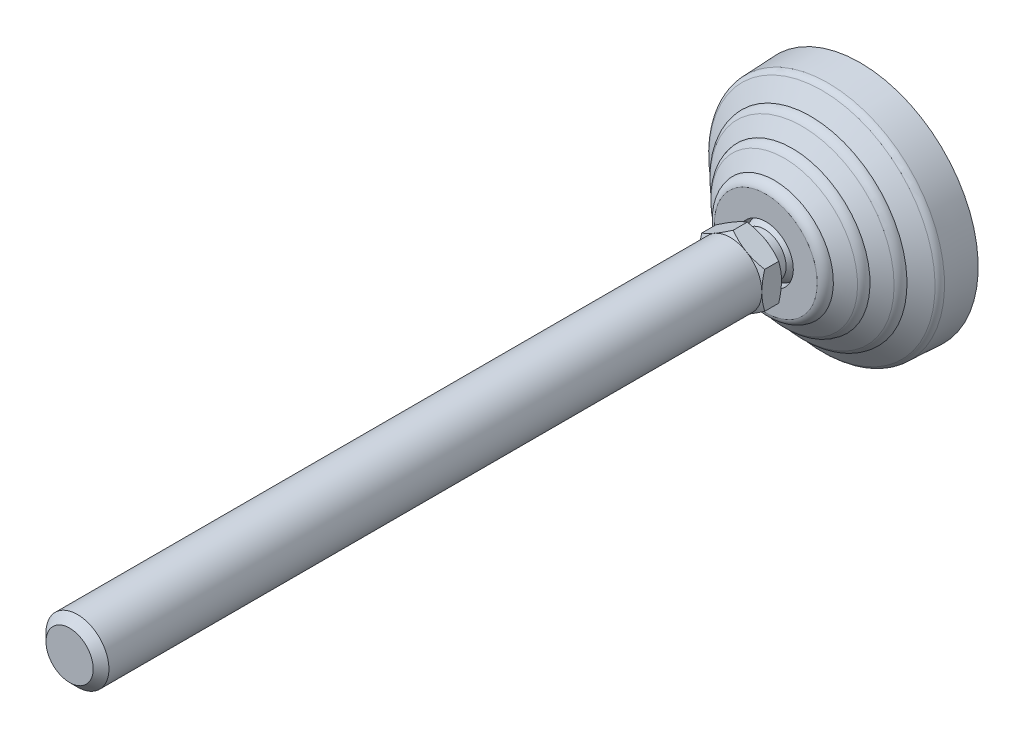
ISO-10303-21;
HEADER;
FILE_DESCRIPTION(('STEP AP214'),'2;1');
FILE_NAME('part.step','',(''),(''),'','','');
FILE_SCHEMA(('AUTOMOTIVE_DESIGN { 1 0 10303 214 1 1 1 1 }'));
ENDSEC;
DATA;
#1=APPLICATION_CONTEXT('core data for automotive mechanical design processes');
#2=APPLICATION_PROTOCOL_DEFINITION('international standard','automotive_design',2000,#1);
#3=PRODUCT_CONTEXT('',#1,'mechanical');
#4=PRODUCT('Part','Part','',(#3));
#5=PRODUCT_RELATED_PRODUCT_CATEGORY('part','',(#4));
#6=PRODUCT_DEFINITION_FORMATION('','',#4);
#7=PRODUCT_DEFINITION_CONTEXT('part definition',#1,'design');
#8=PRODUCT_DEFINITION('design','',#6,#7);
#9=PRODUCT_DEFINITION_SHAPE('','',#8);
#10=(LENGTH_UNIT() NAMED_UNIT(*) SI_UNIT(.MILLI.,.METRE.));
#11=(NAMED_UNIT(*) PLANE_ANGLE_UNIT() SI_UNIT($,.RADIAN.));
#12=(NAMED_UNIT(*) SI_UNIT($,.STERADIAN.) SOLID_ANGLE_UNIT());
#13=UNCERTAINTY_MEASURE_WITH_UNIT(LENGTH_MEASURE(1.E-05),#10,'distance_accuracy_value','');
#14=(GEOMETRIC_REPRESENTATION_CONTEXT(3) GLOBAL_UNCERTAINTY_ASSIGNED_CONTEXT((#13)) GLOBAL_UNIT_ASSIGNED_CONTEXT((#10,
#11,#12)) REPRESENTATION_CONTEXT('',''));
#15=CARTESIAN_POINT('',(0.,0.,0.));
#16=DIRECTION('',(0.,0.,1.));
#17=DIRECTION('',(1.,0.,0.));
#18=AXIS2_PLACEMENT_3D('',#15,#16,#17);
#19=CARTESIAN_POINT('',(0.,0.,85.773));
#20=DIRECTION('',(0.,0.,-1.));
#21=DIRECTION('',(0.,1.,0.));
#22=AXIS2_PLACEMENT_3D('',#19,#20,#21);
#23=CYLINDRICAL_SURFACE('',#22,8.);
#24=CARTESIAN_POINT('',(0.,0.,199.));
#25=DIRECTION('',(0.,0.,1.));
#26=DIRECTION('',(0.,-1.,0.));
#27=AXIS2_PLACEMENT_3D('',#24,#25,#26);
#28=CIRCLE('',#27,8.);
#29=CARTESIAN_POINT('',(0.,-8.,199.));
#30=VERTEX_POINT('',#29);
#31=EDGE_CURVE('E9',#30,#30,#28,.F.);
#32=ORIENTED_EDGE('',*,*,#31,.T.);
#33=EDGE_LOOP('',(#32));
#34=FACE_BOUND('',#33,.T.);
#35=CARTESIAN_POINT('',(0.,0.,33.));
#36=DIRECTION('',(0.,0.,-1.));
#37=DIRECTION('',(0.,1.,0.));
#38=AXIS2_PLACEMENT_3D('',#35,#36,#37);
#39=CIRCLE('',#38,8.);
#40=CARTESIAN_POINT('',(0.,8.,33.));
#41=VERTEX_POINT('',#40);
#42=EDGE_CURVE('E124',#41,#41,#39,.F.);
#43=ORIENTED_EDGE('',*,*,#42,.T.);
#44=EDGE_LOOP('',(#43));
#45=FACE_BOUND('',#44,.T.);
#46=ADVANCED_FACE('F14',(#34,#45),#23,.T.);
#47=CARTESIAN_POINT('',(7.995,0.,33.));
#48=DIRECTION('',(0.,0.,-1.));
#49=DIRECTION('',(0.,1.,0.));
#50=AXIS2_PLACEMENT_3D('',#47,#48,#49);
#51=PLANE('',#50);
#52=CARTESIAN_POINT('',(0.,0.,33.));
#53=DIRECTION('',(0.,0.,-1.));
#54=DIRECTION('',(0.,1.,0.));
#55=AXIS2_PLACEMENT_3D('',#52,#53,#54);
#56=CIRCLE('',#55,7.99);
#57=CARTESIAN_POINT('',(0.,7.99,33.));
#58=VERTEX_POINT('',#57);
#59=EDGE_CURVE('E132',#58,#58,#56,.F.);
#60=ORIENTED_EDGE('',*,*,#59,.T.);
#61=EDGE_LOOP('',(#60));
#62=FACE_BOUND('',#61,.T.);
#63=ORIENTED_EDGE('',*,*,#42,.F.);
#64=EDGE_LOOP('',(#63));
#65=FACE_BOUND('',#64,.T.);
#66=ADVANCED_FACE('F157',(#62,#65),#51,.T.);
#67=CARTESIAN_POINT('',(0.,0.,32.2753734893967));
#68=DIRECTION('',(0.,0.,-1.));
#69=DIRECTION('',(0.,1.,0.));
#70=AXIS2_PLACEMENT_3D('',#67,#68,#69);
#71=CONICAL_SURFACE('',#70,9.2450899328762,1.0471975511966);
#72=ORIENTED_EDGE('',*,*,#59,.F.);
#73=EDGE_LOOP('',(#72));
#74=FACE_BOUND('',#73,.T.);
#75=CARTESIAN_POINT('',(-4.19327851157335E-08,-9.23760428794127,32.2796952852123));
#76=CARTESIAN_POINT('',(0.175847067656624,-9.13607893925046,32.3382996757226));
#77=CARTESIAN_POINT('',(0.352349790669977,-9.03417505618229,32.3942441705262));
#78=CARTESIAN_POINT('',(0.706788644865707,-8.82953969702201,32.5000807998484));
#79=CARTESIAN_POINT('',(0.884725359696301,-8.72680788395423,32.5499703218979));
#80=CARTESIAN_POINT('',(1.42138431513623,-8.41696768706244,32.6895770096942));
#81=CARTESIAN_POINT('',(1.78222493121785,-8.20863626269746,32.7689823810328));
#82=CARTESIAN_POINT('',(2.32221590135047,-7.896872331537,32.862092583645));
#83=CARTESIAN_POINT('',(2.49975318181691,-7.79437113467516,32.8886165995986));
#84=CARTESIAN_POINT('',(2.85563052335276,-7.58890525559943,32.9330919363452));
#85=CARTESIAN_POINT('',(3.03397051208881,-7.48594061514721,32.9510440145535));
#86=CARTESIAN_POINT('',(3.3909574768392,-7.27983409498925,32.9779205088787));
#87=CARTESIAN_POINT('',(3.56960387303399,-7.17669255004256,32.9868551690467));
#88=CARTESIAN_POINT('',(3.92706158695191,-6.97031424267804,32.9955052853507));
#89=CARTESIAN_POINT('',(4.10587289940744,-6.86707748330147,32.995221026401));
#90=CARTESIAN_POINT('',(4.44015430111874,-6.67408002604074,32.9860752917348));
#91=CARTESIAN_POINT('',(4.59564800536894,-6.58430569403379,32.9783294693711));
#92=CARTESIAN_POINT('',(4.90627121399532,-6.4049673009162,32.956016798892));
#93=CARTESIAN_POINT('',(5.06140069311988,-6.31540325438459,32.9414494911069));
#94=CARTESIAN_POINT('',(5.52618852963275,-6.04705787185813,32.8878596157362));
#95=CARTESIAN_POINT('',(5.83502420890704,-5.86875150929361,32.8389557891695));
#96=CARTESIAN_POINT('',(6.45597113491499,-5.51024763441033,32.7166979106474));
#97=CARTESIAN_POINT('',(6.76800315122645,-5.33009586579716,32.6428257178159));
#98=CARTESIAN_POINT('',(7.38741452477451,-4.97247854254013,32.4751673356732));
#99=CARTESIAN_POINT('',(7.69480181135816,-4.79500840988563,32.3814205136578));
#100=CARTESIAN_POINT('',(7.9999999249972,-4.6188021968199,32.2796953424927));
#101=B_SPLINE_CURVE_WITH_KNOTS('',3,(#75,#76,#77,#78,#79,#80,#81,#82,#83,#84,#85,#86,#87,#88,
#89,#90,#91,#92,#93,#94,#95,#96,#97,#98,#99,#100),.UNSPECIFIED.,.F.,.F.,(4,2,2,2,2,2,2,2,2,2,2,
2,4),(0.,0.633965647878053,1.26820386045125,2.53931509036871,3.15930425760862,3.77923863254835,
4.39846794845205,5.01767812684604,5.55669080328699,6.09573980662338,7.17460542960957,
8.2773951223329,9.37802050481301),.UNSPECIFIED.);
#102=CARTESIAN_POINT('',(-1.44240227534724E-08,-9.23760431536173,32.2796953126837));
#103=VERTEX_POINT('',#102);
#104=CARTESIAN_POINT('',(8.,-4.61880217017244,32.2796953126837));
#105=VERTEX_POINT('',#104);
#106=EDGE_CURVE('E143',#103,#105,#101,.T.);
#107=ORIENTED_EDGE('',*,*,#106,.T.);
#108=CARTESIAN_POINT('',(7.9999999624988,-4.6188021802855,32.2796952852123));
#109=CARTESIAN_POINT('',(7.99999998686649,-4.23969380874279,32.3891659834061));
#110=CARTESIAN_POINT('',(7.999999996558,-3.85751175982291,32.4893813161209));
#111=CARTESIAN_POINT('',(8.00000000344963,-3.08693961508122,32.6664987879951));
#112=CARTESIAN_POINT('',(8.00000000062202,-2.69853763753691,32.7433487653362));
#113=CARTESIAN_POINT('',(7.99999999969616,-2.11699996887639,32.8364192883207));
#114=CARTESIAN_POINT('',(7.99999999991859,-1.92560834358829,32.8635449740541));
#115=CARTESIAN_POINT('',(8.0000000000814,-1.54193621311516,32.9104602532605));
#116=CARTESIAN_POINT('',(8.0000000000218,-1.34965578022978,32.9302504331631));
#117=CARTESIAN_POINT('',(7.99999999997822,-0.96464588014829,32.962068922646));
#118=CARTESIAN_POINT('',(7.99999999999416,-0.771917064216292,32.9741050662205));
#119=CARTESIAN_POINT('',(8.00000000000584,-0.386125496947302,32.9901838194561));
#120=CARTESIAN_POINT('',(8.00000000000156,-0.193062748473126,32.9942264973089));
#121=CARTESIAN_POINT('',(7.99999999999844,0.193062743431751,32.9942264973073));
#122=CARTESIAN_POINT('',(7.99999999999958,0.386125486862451,32.990183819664));
#123=CARTESIAN_POINT('',(8.00000000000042,0.771917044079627,32.9741050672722));
#124=CARTESIAN_POINT('',(8.00000000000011,0.96464585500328,32.962068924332));
#125=CARTESIAN_POINT('',(7.99999999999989,1.34965574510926,32.930250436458));
#126=CARTESIAN_POINT('',(7.99999999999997,1.54193617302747,32.9104602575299));
#127=CARTESIAN_POINT('',(8.00000000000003,1.92560829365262,32.8635449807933));
#128=CARTESIAN_POINT('',(8.00000000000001,2.11699991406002,32.8364192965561));
#129=CARTESIAN_POINT('',(7.99999999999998,2.69853756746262,32.7433487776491));
#130=CARTESIAN_POINT('',(7.99999999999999,3.0869395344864,32.6664988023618));
#131=CARTESIAN_POINT('',(8.00000000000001,3.85751166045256,32.4893813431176));
#132=CARTESIAN_POINT('',(8.00000000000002,4.23969370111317,32.3891660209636));
#133=CARTESIAN_POINT('',(8.,4.61880206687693,32.2796953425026));
#134=B_SPLINE_CURVE_WITH_KNOTS('',3,(#108,#109,#110,#111,#112,#113,#114,#115,#116,#117,#118,
#119,#120,#121,#122,#123,#124,#125,#126,#127,#128,#129,#130,#131,#132,#133),.UNSPECIFIED.,.F.,
.F.,(4,2,2,2,2,2,2,2,2,2,2,2,4),(0.,1.1842935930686,2.37121196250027,2.95099639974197,
3.53073447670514,4.10988591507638,4.68903241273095,5.26817889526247,5.84733031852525,
6.42706838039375,7.00685280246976,8.19377114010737,9.37806470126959),.UNSPECIFIED.);
#135=CARTESIAN_POINT('',(8.00000001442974,4.618802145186,32.2796953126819));
#136=VERTEX_POINT('',#135);
#137=EDGE_CURVE('E135',#105,#136,#134,.T.);
#138=ORIENTED_EDGE('',*,*,#137,.T.);
#139=CARTESIAN_POINT('',(8.00000000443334,4.61880210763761,32.2796952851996));
#140=CARTESIAN_POINT('',(7.82415291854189,4.72032749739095,32.3382996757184));
#141=CARTESIAN_POINT('',(7.64765020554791,4.8222313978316,32.3942441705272));
#142=CARTESIAN_POINT('',(7.29321135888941,5.02686677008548,32.500080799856));
#143=CARTESIAN_POINT('',(7.11527464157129,5.12959857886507,32.549970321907));
#144=CARTESIAN_POINT('',(6.57861568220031,5.43943876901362,32.689577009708));
#145=CARTESIAN_POINT('',(6.21777506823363,5.6477701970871,32.7689823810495));
#146=CARTESIAN_POINT('',(5.67778409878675,5.95953412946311,32.8620925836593));
#147=CARTESIAN_POINT('',(5.50024681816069,6.06203532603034,32.8886165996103));
#148=CARTESIAN_POINT('',(5.14436947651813,6.2675012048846,32.9330919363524));
#149=CARTESIAN_POINT('',(4.96602948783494,6.37046584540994,32.9510440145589));
#150=CARTESIAN_POINT('',(4.60904252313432,6.57657236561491,32.977920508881));
#151=CARTESIAN_POINT('',(4.43039612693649,6.6797139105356,32.986855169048));
#152=CARTESIAN_POINT('',(4.0729384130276,6.88609221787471,32.9955052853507));
#153=CARTESIAN_POINT('',(3.89412710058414,6.98932897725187,32.9952210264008));
#154=CARTESIAN_POINT('',(3.55984569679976,7.18232643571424,32.9860752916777));
#155=CARTESIAN_POINT('',(3.40435199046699,7.27210076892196,32.9783294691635));
#156=CARTESIAN_POINT('',(3.09372877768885,7.45143916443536,32.9560167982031));
#157=CARTESIAN_POINT('',(2.93859929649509,7.54100321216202,32.9414494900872));
#158=CARTESIAN_POINT('',(2.47381145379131,7.80934859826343,32.8878596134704));
#159=CARTESIAN_POINT('',(2.16497577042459,7.98765496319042,32.8389557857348));
#160=CARTESIAN_POINT('',(1.54402883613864,8.34615884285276,32.7166979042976));
#161=CARTESIAN_POINT('',(1.23199681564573,8.52631061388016,32.6428257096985));
#162=CARTESIAN_POINT('',(0.612585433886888,8.8839279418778,32.4751673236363));
#163=CARTESIAN_POINT('',(0.305198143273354,9.06139807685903,32.3814204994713));
#164=CARTESIAN_POINT('',(2.56600579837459E-08,9.23760429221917,32.2796953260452));
#165=B_SPLINE_CURVE_WITH_KNOTS('',3,(#139,#140,#141,#142,#143,#144,#145,#146,#147,#148,#149,
#150,#151,#152,#153,#154,#155,#156,#157,#158,#159,#160,#161,#162,#163,#164),.UNSPECIFIED.,.F.,
.F.,(4,2,2,2,2,2,2,2,2,2,2,2,4),(0.,0.633965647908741,1.26820386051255,2.53931509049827,
3.15930425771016,3.77923863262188,4.39846794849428,5.01767812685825,5.55669081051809,
6.09573982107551,7.1746054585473,8.27739516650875,9.37802056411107),.UNSPECIFIED.);
#166=CARTESIAN_POINT('',(-1.15386855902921E-08,9.23760430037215,32.279695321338));
#167=VERTEX_POINT('',#166);
#168=EDGE_CURVE('E180',#136,#167,#165,.T.);
#169=ORIENTED_EDGE('',*,*,#168,.T.);
#170=CARTESIAN_POINT('',(-1.65350876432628E-08,9.23760427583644,32.2796953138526));
#171=CARTESIAN_POINT('',(-0.175847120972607,9.13607891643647,32.3382996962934));
#172=CARTESIAN_POINT('',(-0.352349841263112,9.03417502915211,32.3942441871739));
#173=CARTESIAN_POINT('',(-0.706788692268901,8.82953966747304,32.5000808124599));
#174=CARTESIAN_POINT('',(-0.884725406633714,8.72680785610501,32.5499703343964));
#175=CARTESIAN_POINT('',(-1.42138436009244,8.41696766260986,32.6895770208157));
#176=CARTESIAN_POINT('',(-1.78222497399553,8.20863623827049,32.7689823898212));
#177=CARTESIAN_POINT('',(-2.32221594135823,7.89687230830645,32.8620925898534));
#178=CARTESIAN_POINT('',(-2.4997532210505,7.79437111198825,32.8886166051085));
#179=CARTESIAN_POINT('',(-2.85563056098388,7.58890523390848,32.9330919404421));
#180=CARTESIAN_POINT('',(-3.03397054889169,7.48594059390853,32.9510440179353));
#181=CARTESIAN_POINT('',(-3.39095751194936,7.27983407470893,32.9779205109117));
#182=CARTESIAN_POINT('',(-3.56960390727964,7.1766925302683,32.9868551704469));
#183=CARTESIAN_POINT('',(-3.92706161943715,6.97031422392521,32.9955052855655));
#184=CARTESIAN_POINT('',(-4.10587293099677,6.867077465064,32.9952210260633));
#185=CARTESIAN_POINT('',(-4.44015433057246,6.67408000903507,32.9860752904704));
#186=CARTESIAN_POINT('',(-4.59564803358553,6.58430567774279,32.9783294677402));
#187=CARTESIAN_POINT('',(-4.90627123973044,6.40496728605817,32.9560167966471));
#188=CARTESIAN_POINT('',(-5.06140071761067,6.31540324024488,32.9414494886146));
#189=CARTESIAN_POINT('',(-5.52618855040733,6.04705785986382,32.8878596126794));
#190=CARTESIAN_POINT('',(-5.83502422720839,5.8687514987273,32.8389557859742));
#191=CARTESIAN_POINT('',(-6.45597114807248,5.51024762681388,32.7166979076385));
#192=CARTESIAN_POINT('',(-6.76800316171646,5.33009585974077,32.6428257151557));
#193=CARTESIAN_POINT('',(-7.38741452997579,4.97247853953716,32.4751673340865));
#194=CARTESIAN_POINT('',(-7.69480181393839,4.7950084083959,32.381420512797));
#195=CARTESIAN_POINT('',(-7.9999999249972,4.6188021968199,32.2796953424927));
#196=B_SPLINE_CURVE_WITH_KNOTS('',3,(#170,#171,#172,#173,#174,#175,#176,#177,#178,#179,#180,
#181,#182,#183,#184,#185,#186,#187,#188,#189,#190,#191,#192,#193,#194,#195),.UNSPECIFIED.,.F.,
.F.,(4,2,2,2,2,2,2,2,2,2,2,2,4),(0.,0.633965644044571,1.26820385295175,2.5393150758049,
3.15930423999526,3.77923861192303,4.39846792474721,5.01767810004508,5.55669077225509,
6.09573977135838,7.17460538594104,8.27739506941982,9.37802044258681),.UNSPECIFIED.);
#197=CARTESIAN_POINT('',(-8.,4.61880217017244,32.2796953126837));
#198=VERTEX_POINT('',#197);
#199=EDGE_CURVE('E172',#167,#198,#196,.T.);
#200=ORIENTED_EDGE('',*,*,#199,.T.);
#201=CARTESIAN_POINT('',(-7.9999999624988,4.6188021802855,32.2796952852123));
#202=CARTESIAN_POINT('',(-7.99999998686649,4.23969380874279,32.3891659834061));
#203=CARTESIAN_POINT('',(-7.999999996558,3.85751175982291,32.4893813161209));
#204=CARTESIAN_POINT('',(-8.00000000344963,3.08693961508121,32.6664987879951));
#205=CARTESIAN_POINT('',(-8.00000000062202,2.69853763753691,32.7433487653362));
#206=CARTESIAN_POINT('',(-7.99999999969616,2.11699996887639,32.8364192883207));
#207=CARTESIAN_POINT('',(-7.99999999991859,1.92560834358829,32.8635449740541));
#208=CARTESIAN_POINT('',(-8.0000000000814,1.54193621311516,32.9104602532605));
#209=CARTESIAN_POINT('',(-8.0000000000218,1.34965578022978,32.9302504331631));
#210=CARTESIAN_POINT('',(-7.99999999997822,0.964645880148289,32.962068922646));
#211=CARTESIAN_POINT('',(-7.99999999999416,0.77191706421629,32.9741050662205));
#212=CARTESIAN_POINT('',(-8.00000000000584,0.386125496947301,32.9901838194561));
#213=CARTESIAN_POINT('',(-8.00000000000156,0.193062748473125,32.9942264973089));
#214=CARTESIAN_POINT('',(-7.99999999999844,-0.193062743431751,32.9942264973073));
#215=CARTESIAN_POINT('',(-7.99999999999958,-0.386125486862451,32.990183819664));
#216=CARTESIAN_POINT('',(-8.00000000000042,-0.771917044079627,32.9741050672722));
#217=CARTESIAN_POINT('',(-8.00000000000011,-0.96464585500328,32.962068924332));
#218=CARTESIAN_POINT('',(-7.99999999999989,-1.34965574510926,32.930250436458));
#219=CARTESIAN_POINT('',(-7.99999999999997,-1.54193617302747,32.9104602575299));
#220=CARTESIAN_POINT('',(-8.00000000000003,-1.92560829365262,32.8635449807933));
#221=CARTESIAN_POINT('',(-8.00000000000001,-2.11699991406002,32.8364192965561));
#222=CARTESIAN_POINT('',(-7.99999999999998,-2.69853756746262,32.7433487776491));
#223=CARTESIAN_POINT('',(-7.99999999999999,-3.0869395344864,32.6664988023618));
#224=CARTESIAN_POINT('',(-8.00000000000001,-3.85751166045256,32.4893813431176));
#225=CARTESIAN_POINT('',(-8.00000000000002,-4.23969370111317,32.3891660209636));
#226=CARTESIAN_POINT('',(-8.,-4.61880206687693,32.2796953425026));
#227=B_SPLINE_CURVE_WITH_KNOTS('',3,(#201,#202,#203,#204,#205,#206,#207,#208,#209,#210,#211,
#212,#213,#214,#215,#216,#217,#218,#219,#220,#221,#222,#223,#224,#225,#226),.UNSPECIFIED.,.F.,
.F.,(4,2,2,2,2,2,2,2,2,2,2,2,4),(0.,1.18429359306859,2.37121196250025,2.95099639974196,
3.53073447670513,4.10988591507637,4.68903241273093,5.26817889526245,5.84733031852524,
6.42706838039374,7.00685280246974,8.19377114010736,9.37806470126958),.UNSPECIFIED.);
#228=CARTESIAN_POINT('',(-8.00000001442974,-4.61880214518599,32.2796953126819));
#229=VERTEX_POINT('',#228);
#230=EDGE_CURVE('E342',#198,#229,#227,.T.);
#231=ORIENTED_EDGE('',*,*,#230,.T.);
#232=CARTESIAN_POINT('',(-8.00000000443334,-4.61880210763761,32.2796952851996));
#233=CARTESIAN_POINT('',(-7.82415291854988,-4.72032749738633,32.3382996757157));
#234=CARTESIAN_POINT('',(-7.64765020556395,-4.82223139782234,32.3942441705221));
#235=CARTESIAN_POINT('',(-7.29321135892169,-5.02686677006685,32.5000807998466));
#236=CARTESIAN_POINT('',(-7.11527464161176,-5.1295985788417,32.5499703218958));
#237=CARTESIAN_POINT('',(-6.57861568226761,-5.43943876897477,32.6895770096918));
#238=CARTESIAN_POINT('',(-6.21777506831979,-5.64777019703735,32.7689823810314));
#239=CARTESIAN_POINT('',(-5.67778409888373,-5.95953412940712,32.8620925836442));
#240=CARTESIAN_POINT('',(-5.50024681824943,-6.06203532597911,32.8886165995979));
#241=CARTESIAN_POINT('',(-5.14436947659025,-6.26750120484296,32.9330919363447));
#242=CARTESIAN_POINT('',(-4.96602948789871,-6.37046584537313,32.9510440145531));
#243=CARTESIAN_POINT('',(-4.60904252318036,-6.57657236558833,32.9779205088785));
#244=CARTESIAN_POINT('',(-4.43039612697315,-6.67971391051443,32.9868551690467));
#245=CARTESIAN_POINT('',(-4.0729384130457,-6.88609221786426,32.9955052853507));
#246=CARTESIAN_POINT('',(-3.89412710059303,-6.98932897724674,32.995221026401));
#247=CARTESIAN_POINT('',(-3.55984569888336,-7.18232643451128,32.9860752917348));
#248=CARTESIAN_POINT('',(-3.40435199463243,-7.27210076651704,32.9783294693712));
#249=CARTESIAN_POINT('',(-3.09372878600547,-7.45143915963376,32.9560167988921));
#250=CARTESIAN_POINT('',(-2.93859930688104,-7.54100320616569,32.941449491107));
#251=CARTESIAN_POINT('',(-2.47381147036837,-7.80934858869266,32.8878596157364));
#252=CARTESIAN_POINT('',(-2.16497579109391,-7.98765495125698,32.8389557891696));
#253=CARTESIAN_POINT('',(-1.54402886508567,-8.34615882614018,32.7166979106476));
#254=CARTESIAN_POINT('',(-1.2319968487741,-8.52631059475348,32.642825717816));
#255=CARTESIAN_POINT('',(-0.612585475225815,-8.88392791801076,32.4751673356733));
#256=CARTESIAN_POINT('',(-0.305198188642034,-9.06139805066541,32.3814205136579));
#257=CARTESIAN_POINT('',(-7.50027841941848E-08,-9.23760426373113,32.2796953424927));
#258=B_SPLINE_CURVE_WITH_KNOTS('',3,(#232,#233,#234,#235,#236,#237,#238,#239,#240,#241,#242,
#243,#244,#245,#246,#247,#248,#249,#250,#251,#252,#253,#254,#255,#256,#257),.UNSPECIFIED.,.F.,
.F.,(4,2,2,2,2,2,2,2,2,2,2,2,4),(0.,0.633965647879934,1.26820386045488,2.53931509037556,
3.15930425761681,3.77923863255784,4.39846794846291,5.01767812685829,5.55669080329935,
6.09573980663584,7.17460542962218,8.27739512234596,9.37802050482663),.UNSPECIFIED.);
#259=EDGE_CURVE('E162',#229,#103,#258,.T.);
#260=ORIENTED_EDGE('',*,*,#259,.T.);
#261=EDGE_LOOP('',(#107,#138,#169,#200,#231,#260));
#262=FACE_BOUND('',#261,.T.);
#263=ADVANCED_FACE('F152',(#74,#262),#71,.T.);
#264=CARTESIAN_POINT('',(0.,-9.23760430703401,33.1));
#265=DIRECTION('',(0.5,0.866025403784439,0.));
#266=DIRECTION('',(-0.866025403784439,0.5,0.));
#267=AXIS2_PLACEMENT_3D('',#264,#265,#266);
#268=PLANE('',#267);
#269=DIRECTION('',(0.,0.,1.));
#270=VECTOR('',#269,1.);
#271=CARTESIAN_POINT('',(0.,-9.23760430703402,33.1));
#272=LINE('',#271,#270);
#273=CARTESIAN_POINT('',(0.,-9.23760430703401,28.7203046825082));
#274=VERTEX_POINT('',#273);
#275=EDGE_CURVE('E368',#274,#103,#272,.T.);
#276=ORIENTED_EDGE('',*,*,#275,.T.);
#277=ORIENTED_EDGE('',*,*,#259,.F.);
#278=DIRECTION('',(0.,0.,1.));
#279=VECTOR('',#278,1.);
#280=CARTESIAN_POINT('',(-8.,-4.61880215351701,33.1));
#281=LINE('',#280,#279);
#282=CARTESIAN_POINT('',(-8.,-4.61880215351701,28.7203046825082));
#283=VERTEX_POINT('',#282);
#284=EDGE_CURVE('E360',#283,#229,#281,.T.);
#285=ORIENTED_EDGE('',*,*,#284,.F.);
#286=CARTESIAN_POINT('',(0.,-9.23760430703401,28.7203046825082));
#287=CARTESIAN_POINT('',(-0.175847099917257,-9.13607893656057,28.6617003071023));
#288=CARTESIAN_POINT('',(-0.35234981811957,-9.03417504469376,28.6057558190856));
#289=CARTESIAN_POINT('',(-0.706788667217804,-8.82953967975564,28.4999191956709));
#290=CARTESIAN_POINT('',(-0.884725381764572,-8.72680786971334,28.4500296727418));
#291=CARTESIAN_POINT('',(-1.42138433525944,-8.41696767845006,28.3104229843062));
#292=CARTESIAN_POINT('',(-1.78222494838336,-8.20863625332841,28.2310176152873));
#293=CARTESIAN_POINT('',(-2.32221591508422,-7.89687232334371,28.1379074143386));
#294=CARTESIAN_POINT('',(-2.49975319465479,-7.79437112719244,28.1113833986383));
#295=CARTESIAN_POINT('',(-2.8556305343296,-7.5889052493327,28.0669080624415));
#296=CARTESIAN_POINT('',(-3.03397052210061,-7.48594060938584,28.0489559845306));
#297=CARTESIAN_POINT('',(-3.3909574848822,-7.2798340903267,28.0220794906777));
#298=CARTESIAN_POINT('',(-3.56960388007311,-7.17669254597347,28.0131448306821));
#299=CARTESIAN_POINT('',(-3.9270615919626,-6.97031423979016,28.0044947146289));
#300=CARTESIAN_POINT('',(-4.10587290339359,-6.86707748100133,28.0047789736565));
#301=CARTESIAN_POINT('',(-4.44015430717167,-6.67408002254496,28.0139247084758));
#302=CARTESIAN_POINT('',(-4.59564801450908,-6.58430568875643,28.0216705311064));
#303=CARTESIAN_POINT('',(-4.90627122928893,-6.40496729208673,28.0439832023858));
#304=CARTESIAN_POINT('',(-5.06140071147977,-6.3154032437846,28.0585505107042));
#305=CARTESIAN_POINT('',(-5.52618855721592,-6.04705785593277,28.1121403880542));
#306=CARTESIAN_POINT('',(-5.83502424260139,-5.86875148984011,28.161044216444));
#307=CARTESIAN_POINT('',(-6.45597118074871,-5.51024760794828,28.2833020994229));
#308=CARTESIAN_POINT('',(-6.76800320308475,-5.33009583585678,28.3571742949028));
#309=CARTESIAN_POINT('',(-7.38741458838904,-4.97247850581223,28.5248326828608));
#310=CARTESIAN_POINT('',(-7.69480188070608,-4.79500836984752,28.6185795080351));
#311=CARTESIAN_POINT('',(-8.,-4.61880215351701,28.7203046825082));
#312=B_SPLINE_CURVE_WITH_KNOTS('',3,(#286,#287,#288,#289,#290,#291,#292,#293,#294,#295,#296,
#297,#298,#299,#300,#301,#302,#303,#304,#305,#306,#307,#308,#309,#310,#311),.UNSPECIFIED.,.F.,
.F.,(4,2,2,2,2,2,2,2,2,2,2,2,4),(0.,0.633965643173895,1.26820385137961,2.53931507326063,
3.15930423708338,3.77923860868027,4.3984679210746,5.01767809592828,5.55669078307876,
6.0957397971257,7.17460544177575,8.27739515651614,9.37802056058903),.UNSPECIFIED.);
#313=EDGE_CURVE('E362',#274,#283,#312,.T.);
#314=ORIENTED_EDGE('',*,*,#313,.F.);
#315=EDGE_LOOP('',(#276,#277,#285,#314));
#316=FACE_BOUND('',#315,.T.);
#317=ADVANCED_FACE('F156',(#316),#268,.F.);
#318=CARTESIAN_POINT('',(8.,-4.61880215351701,33.1));
#319=DIRECTION('',(-0.5,0.866025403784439,0.));
#320=DIRECTION('',(-0.866025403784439,-0.5,0.));
#321=AXIS2_PLACEMENT_3D('',#318,#319,#320);
#322=PLANE('',#321);
#323=DIRECTION('',(0.,0.,1.));
#324=VECTOR('',#323,1.);
#325=CARTESIAN_POINT('',(8.,-4.61880215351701,33.1));
#326=LINE('',#325,#324);
#327=CARTESIAN_POINT('',(8.,-4.61880215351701,28.7203046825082));
#328=VERTEX_POINT('',#327);
#329=EDGE_CURVE('E31',#328,#105,#326,.T.);
#330=ORIENTED_EDGE('',*,*,#329,.T.);
#331=ORIENTED_EDGE('',*,*,#106,.F.);
#332=ORIENTED_EDGE('',*,*,#275,.F.);
#333=CARTESIAN_POINT('',(8.,-4.61880215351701,28.7203046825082));
#334=CARTESIAN_POINT('',(7.82415290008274,-4.72032752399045,28.6617003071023));
#335=CARTESIAN_POINT('',(7.64765018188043,-4.82223141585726,28.6057558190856));
#336=CARTESIAN_POINT('',(7.2932113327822,-5.02686678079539,28.4999191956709));
#337=CARTESIAN_POINT('',(7.11527461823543,-5.12959859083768,28.4500296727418));
#338=CARTESIAN_POINT('',(6.57861566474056,-5.43943878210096,28.3104229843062));
#339=CARTESIAN_POINT('',(6.21777505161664,-5.64777020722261,28.2310176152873));
#340=CARTESIAN_POINT('',(5.67778408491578,-5.95953413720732,28.1379074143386));
#341=CARTESIAN_POINT('',(5.50024680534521,-6.06203533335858,28.1113833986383));
#342=CARTESIAN_POINT('',(5.14436946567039,-6.26750121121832,28.0669080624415));
#343=CARTESIAN_POINT('',(4.96602947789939,-6.37046585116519,28.0489559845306));
#344=CARTESIAN_POINT('',(4.60904251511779,-6.57657237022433,28.0220794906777));
#345=CARTESIAN_POINT('',(4.43039611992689,-6.67971391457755,28.0131448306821));
#346=CARTESIAN_POINT('',(4.0729384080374,-6.88609222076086,28.0044947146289));
#347=CARTESIAN_POINT('',(3.89412709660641,-6.98932897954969,28.0047789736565));
#348=CARTESIAN_POINT('',(3.55984569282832,-7.18232643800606,28.0139247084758));
#349=CARTESIAN_POINT('',(3.40435198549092,-7.2721007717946,28.0216705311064));
#350=CARTESIAN_POINT('',(3.09372877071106,-7.45143916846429,28.0439832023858));
#351=CARTESIAN_POINT('',(2.93859928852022,-7.54100321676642,28.0585505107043));
#352=CARTESIAN_POINT('',(2.47381144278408,-7.80934860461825,28.1121403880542));
#353=CARTESIAN_POINT('',(2.16497575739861,-7.98765497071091,28.161044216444));
#354=CARTESIAN_POINT('',(1.54402881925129,-8.34615885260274,28.2833020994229));
#355=CARTESIAN_POINT('',(1.23199679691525,-8.52631062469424,28.3571742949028));
#356=CARTESIAN_POINT('',(0.612585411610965,-8.88392795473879,28.5248326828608));
#357=CARTESIAN_POINT('',(0.305198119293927,-9.0613980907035,28.6185795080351));
#358=CARTESIAN_POINT('',(0.,-9.23760430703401,28.7203046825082));
#359=B_SPLINE_CURVE_WITH_KNOTS('',3,(#333,#334,#335,#336,#337,#338,#339,#340,#341,#342,#343,
#344,#345,#346,#347,#348,#349,#350,#351,#352,#353,#354,#355,#356,#357,#358),.UNSPECIFIED.,.F.,
.F.,(4,2,2,2,2,2,2,2,2,2,2,2,4),(0.,0.633965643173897,1.26820385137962,2.53931507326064,
3.15930423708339,3.77923860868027,4.39846792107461,5.01767809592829,5.55669078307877,
6.09573979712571,7.17460544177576,8.27739515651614,9.37802056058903),.UNSPECIFIED.);
#360=EDGE_CURVE('E369',#328,#274,#359,.T.);
#361=ORIENTED_EDGE('',*,*,#360,.F.);
#362=EDGE_LOOP('',(#330,#331,#332,#361));
#363=FACE_BOUND('',#362,.T.);
#364=ADVANCED_FACE('F375',(#363),#322,.F.);
#365=CARTESIAN_POINT('',(-8.,4.61880215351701,33.1));
#366=DIRECTION('',(0.5,-0.866025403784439,0.));
#367=DIRECTION('',(0.866025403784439,0.5,0.));
#368=AXIS2_PLACEMENT_3D('',#365,#366,#367);
#369=PLANE('',#368);
#370=DIRECTION('',(0.,0.,1.));
#371=VECTOR('',#370,1.);
#372=CARTESIAN_POINT('',(-8.,4.61880215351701,33.1));
#373=LINE('',#372,#371);
#374=CARTESIAN_POINT('',(-8.,4.61880215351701,28.7203046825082));
#375=VERTEX_POINT('',#374);
#376=EDGE_CURVE('E361',#375,#198,#373,.T.);
#377=ORIENTED_EDGE('',*,*,#376,.T.);
#378=ORIENTED_EDGE('',*,*,#199,.F.);
#379=DIRECTION('',(0.,0.,1.));
#380=VECTOR('',#379,1.);
#381=CARTESIAN_POINT('',(0.,9.23760430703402,33.1));
#382=LINE('',#381,#380);
#383=CARTESIAN_POINT('',(0.,9.23760430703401,28.7203046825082));
#384=VERTEX_POINT('',#383);
#385=EDGE_CURVE('E211',#384,#167,#382,.T.);
#386=ORIENTED_EDGE('',*,*,#385,.F.);
#387=CARTESIAN_POINT('',(-8.,4.61880215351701,28.7203046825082));
#388=CARTESIAN_POINT('',(-7.82415290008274,4.72032752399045,28.6617003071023));
#389=CARTESIAN_POINT('',(-7.64765018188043,4.82223141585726,28.6057558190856));
#390=CARTESIAN_POINT('',(-7.2932113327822,5.02686678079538,28.4999191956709));
#391=CARTESIAN_POINT('',(-7.11527461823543,5.12959859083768,28.4500296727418));
#392=CARTESIAN_POINT('',(-6.57861566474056,5.43943878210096,28.3104229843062));
#393=CARTESIAN_POINT('',(-6.21777505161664,5.64777020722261,28.2310176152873));
#394=CARTESIAN_POINT('',(-5.67778408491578,5.95953413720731,28.1379074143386));
#395=CARTESIAN_POINT('',(-5.50024680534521,6.06203533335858,28.1113833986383));
#396=CARTESIAN_POINT('',(-5.1443694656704,6.26750121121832,28.0669080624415));
#397=CARTESIAN_POINT('',(-4.96602947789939,6.37046585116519,28.0489559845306));
#398=CARTESIAN_POINT('',(-4.60904251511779,6.57657237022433,28.0220794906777));
#399=CARTESIAN_POINT('',(-4.43039611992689,6.67971391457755,28.0131448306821));
#400=CARTESIAN_POINT('',(-4.0729384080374,6.88609222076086,28.0044947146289));
#401=CARTESIAN_POINT('',(-3.89412709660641,6.98932897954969,28.0047789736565));
#402=CARTESIAN_POINT('',(-3.55984569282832,7.18232643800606,28.0139247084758));
#403=CARTESIAN_POINT('',(-3.40435198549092,7.2721007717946,28.0216705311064));
#404=CARTESIAN_POINT('',(-3.09372877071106,7.45143916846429,28.0439832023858));
#405=CARTESIAN_POINT('',(-2.93859928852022,7.54100321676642,28.0585505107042));
#406=CARTESIAN_POINT('',(-2.47381144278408,7.80934860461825,28.1121403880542));
#407=CARTESIAN_POINT('',(-2.16497575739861,7.98765497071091,28.161044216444));
#408=CARTESIAN_POINT('',(-1.54402881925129,8.34615885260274,28.2833020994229));
#409=CARTESIAN_POINT('',(-1.23199679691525,8.52631062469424,28.3571742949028));
#410=CARTESIAN_POINT('',(-0.612585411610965,8.88392795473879,28.5248326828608));
#411=CARTESIAN_POINT('',(-0.305198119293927,9.0613980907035,28.6185795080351));
#412=CARTESIAN_POINT('',(0.,9.23760430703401,28.7203046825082));
#413=B_SPLINE_CURVE_WITH_KNOTS('',3,(#387,#388,#389,#390,#391,#392,#393,#394,#395,#396,#397,
#398,#399,#400,#401,#402,#403,#404,#405,#406,#407,#408,#409,#410,#411,#412),.UNSPECIFIED.,.F.,
.F.,(4,2,2,2,2,2,2,2,2,2,2,2,4),(0.,0.633965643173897,1.26820385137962,2.53931507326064,
3.15930423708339,3.77923860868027,4.39846792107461,5.01767809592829,5.55669078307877,
6.09573979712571,7.17460544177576,8.27739515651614,9.37802056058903),.UNSPECIFIED.);
#414=EDGE_CURVE('E213',#375,#384,#413,.T.);
#415=ORIENTED_EDGE('',*,*,#414,.F.);
#416=EDGE_LOOP('',(#377,#378,#386,#415));
#417=FACE_BOUND('',#416,.T.);
#418=ADVANCED_FACE('F199',(#417),#369,.F.);
#419=CARTESIAN_POINT('',(-8.,-4.61880215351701,33.1));
#420=DIRECTION('',(1.,0.,0.));
#421=DIRECTION('',(0.,1.,0.));
#422=AXIS2_PLACEMENT_3D('',#419,#420,#421);
#423=PLANE('',#422);
#424=ORIENTED_EDGE('',*,*,#284,.T.);
#425=ORIENTED_EDGE('',*,*,#230,.F.);
#426=ORIENTED_EDGE('',*,*,#376,.F.);
#427=CARTESIAN_POINT('',(-8.,-4.618802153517,28.7203046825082));
#428=CARTESIAN_POINT('',(-8.,-4.23969378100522,28.6108340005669));
#429=CARTESIAN_POINT('',(-8.,-3.85751173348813,28.5106186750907));
#430=CARTESIAN_POINT('',(-8.,-3.08693959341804,28.333501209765));
#431=CARTESIAN_POINT('',(-8.,-2.69853761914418,28.2566512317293));
#432=CARTESIAN_POINT('',(-8.,-2.11699995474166,28.163580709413));
#433=CARTESIAN_POINT('',(-8.,-1.9256083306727,28.1364550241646));
#434=CARTESIAN_POINT('',(-8.,-1.54193620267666,28.0895397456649));
#435=CARTESIAN_POINT('',(-8.,-1.34965577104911,28.0697495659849));
#436=CARTESIAN_POINT('',(-8.,-0.964645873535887,28.0379310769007));
#437=CARTESIAN_POINT('',(-8.,-0.771917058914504,28.0258949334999));
#438=CARTESIAN_POINT('',(-8.,-0.38612549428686,28.0098161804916));
#439=CARTESIAN_POINT('',(-8.,-0.19306274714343,28.0057735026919));
#440=CARTESIAN_POINT('',(-8.,0.19306274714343,28.0057735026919));
#441=CARTESIAN_POINT('',(-8.,0.38612549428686,28.0098161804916));
#442=CARTESIAN_POINT('',(-8.,0.771917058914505,28.0258949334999));
#443=CARTESIAN_POINT('',(-8.,0.964645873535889,28.0379310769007));
#444=CARTESIAN_POINT('',(-8.,1.34965577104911,28.0697495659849));
#445=CARTESIAN_POINT('',(-8.,1.54193620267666,28.0895397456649));
#446=CARTESIAN_POINT('',(-8.,1.9256083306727,28.1364550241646));
#447=CARTESIAN_POINT('',(-8.,2.11699995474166,28.163580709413));
#448=CARTESIAN_POINT('',(-8.,2.69853761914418,28.2566512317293));
#449=CARTESIAN_POINT('',(-8.,3.08693959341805,28.333501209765));
#450=CARTESIAN_POINT('',(-8.,3.85751173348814,28.5106186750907));
#451=CARTESIAN_POINT('',(-8.,4.23969378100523,28.6108340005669));
#452=CARTESIAN_POINT('',(-8.,4.61880215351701,28.7203046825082));
#453=B_SPLINE_CURVE_WITH_KNOTS('',3,(#427,#428,#429,#430,#431,#432,#433,#434,#435,#436,#437,
#438,#439,#440,#441,#442,#443,#444,#445,#446,#447,#448,#449,#450,#451,#452),.UNSPECIFIED.,.F.,
.F.,(4,2,2,2,2,2,2,2,2,2,2,2,4),(0.,1.18429358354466,2.37121194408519,2.95099637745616,
3.53073445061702,4.10988588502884,4.68903237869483,5.26817887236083,5.84733030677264,
6.42706837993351,7.00685281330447,8.19377117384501,9.37806475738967),.UNSPECIFIED.);
#454=EDGE_CURVE('E354',#283,#375,#453,.T.);
#455=ORIENTED_EDGE('',*,*,#454,.F.);
#456=EDGE_LOOP('',(#424,#425,#426,#455));
#457=FACE_BOUND('',#456,.T.);
#458=ADVANCED_FACE('F348',(#457),#423,.F.);
#459=CARTESIAN_POINT('',(8.,4.61880215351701,33.1));
#460=DIRECTION('',(-1.,0.,0.));
#461=DIRECTION('',(0.,-1.,0.));
#462=AXIS2_PLACEMENT_3D('',#459,#460,#461);
#463=PLANE('',#462);
#464=DIRECTION('',(0.,0.,1.));
#465=VECTOR('',#464,1.);
#466=CARTESIAN_POINT('',(8.,4.61880215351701,33.1));
#467=LINE('',#466,#465);
#468=CARTESIAN_POINT('',(8.,4.61880215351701,28.7203046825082));
#469=VERTEX_POINT('',#468);
#470=EDGE_CURVE('E402',#136,#469,#467,.F.);
#471=ORIENTED_EDGE('',*,*,#470,.F.);
#472=ORIENTED_EDGE('',*,*,#137,.F.);
#473=ORIENTED_EDGE('',*,*,#329,.F.);
#474=CARTESIAN_POINT('',(8.,4.618802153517,28.7203046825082));
#475=CARTESIAN_POINT('',(8.,4.23969378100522,28.6108340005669));
#476=CARTESIAN_POINT('',(8.,3.85751173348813,28.5106186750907));
#477=CARTESIAN_POINT('',(8.,3.08693959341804,28.333501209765));
#478=CARTESIAN_POINT('',(8.,2.69853761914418,28.2566512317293));
#479=CARTESIAN_POINT('',(8.,2.11699995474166,28.163580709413));
#480=CARTESIAN_POINT('',(8.,1.9256083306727,28.1364550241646));
#481=CARTESIAN_POINT('',(8.,1.54193620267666,28.0895397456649));
#482=CARTESIAN_POINT('',(8.,1.34965577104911,28.0697495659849));
#483=CARTESIAN_POINT('',(8.,0.964645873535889,28.0379310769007));
#484=CARTESIAN_POINT('',(8.,0.771917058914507,28.0258949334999));
#485=CARTESIAN_POINT('',(8.,0.386125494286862,28.0098161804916));
#486=CARTESIAN_POINT('',(8.,0.193062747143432,28.0057735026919));
#487=CARTESIAN_POINT('',(8.,-0.193062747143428,28.0057735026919));
#488=CARTESIAN_POINT('',(8.,-0.386125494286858,28.0098161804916));
#489=CARTESIAN_POINT('',(8.,-0.771917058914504,28.0258949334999));
#490=CARTESIAN_POINT('',(8.,-0.964645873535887,28.0379310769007));
#491=CARTESIAN_POINT('',(8.,-1.34965577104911,28.0697495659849));
#492=CARTESIAN_POINT('',(8.,-1.54193620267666,28.0895397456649));
#493=CARTESIAN_POINT('',(8.,-1.9256083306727,28.1364550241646));
#494=CARTESIAN_POINT('',(8.,-2.11699995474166,28.163580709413));
#495=CARTESIAN_POINT('',(8.,-2.69853761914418,28.2566512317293));
#496=CARTESIAN_POINT('',(8.,-3.08693959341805,28.333501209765));
#497=CARTESIAN_POINT('',(8.,-3.85751173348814,28.5106186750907));
#498=CARTESIAN_POINT('',(8.,-4.23969378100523,28.6108340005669));
#499=CARTESIAN_POINT('',(8.,-4.61880215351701,28.7203046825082));
#500=B_SPLINE_CURVE_WITH_KNOTS('',3,(#474,#475,#476,#477,#478,#479,#480,#481,#482,#483,#484,
#485,#486,#487,#488,#489,#490,#491,#492,#493,#494,#495,#496,#497,#498,#499),.UNSPECIFIED.,.F.,
.F.,(4,2,2,2,2,2,2,2,2,2,2,2,4),(0.,1.18429358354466,2.37121194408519,2.95099637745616,
3.53073445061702,4.10988588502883,4.68903237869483,5.26817887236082,5.84733030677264,
6.4270683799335,7.00685281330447,8.19377117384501,9.37806475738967),.UNSPECIFIED.);
#501=EDGE_CURVE('E188',#469,#328,#500,.T.);
#502=ORIENTED_EDGE('',*,*,#501,.F.);
#503=EDGE_LOOP('',(#471,#472,#473,#502));
#504=FACE_BOUND('',#503,.T.);
#505=ADVANCED_FACE('F150',(#504),#463,.F.);
#506=CARTESIAN_POINT('',(0.,9.23760430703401,33.1));
#507=DIRECTION('',(-0.5,-0.866025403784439,0.));
#508=DIRECTION('',(0.866025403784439,-0.5,0.));
#509=AXIS2_PLACEMENT_3D('',#506,#507,#508);
#510=PLANE('',#509);
#511=ORIENTED_EDGE('',*,*,#385,.T.);
#512=ORIENTED_EDGE('',*,*,#168,.F.);
#513=ORIENTED_EDGE('',*,*,#470,.T.);
#514=CARTESIAN_POINT('',(0.,9.23760430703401,28.7203046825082));
#515=CARTESIAN_POINT('',(0.175847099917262,9.13607893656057,28.6617003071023));
#516=CARTESIAN_POINT('',(0.352349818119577,9.03417504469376,28.6057558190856));
#517=CARTESIAN_POINT('',(0.706788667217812,8.82953967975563,28.4999191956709));
#518=CARTESIAN_POINT('',(0.884725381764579,8.72680786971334,28.4500296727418));
#519=CARTESIAN_POINT('',(1.42138433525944,8.41696767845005,28.3104229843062));
#520=CARTESIAN_POINT('',(1.78222494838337,8.20863625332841,28.2310176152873));
#521=CARTESIAN_POINT('',(2.32221591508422,7.8968723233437,28.1379074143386));
#522=CARTESIAN_POINT('',(2.49975319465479,7.79437112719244,28.1113833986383));
#523=CARTESIAN_POINT('',(2.85563053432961,7.5889052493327,28.0669080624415));
#524=CARTESIAN_POINT('',(3.03397052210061,7.48594060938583,28.0489559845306));
#525=CARTESIAN_POINT('',(3.39095748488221,7.27983409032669,28.0220794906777));
#526=CARTESIAN_POINT('',(3.56960388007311,7.17669254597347,28.0131448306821));
#527=CARTESIAN_POINT('',(3.9270615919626,6.97031423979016,28.0044947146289));
#528=CARTESIAN_POINT('',(4.10587290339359,6.86707748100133,28.0047789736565));
#529=CARTESIAN_POINT('',(4.44015430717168,6.67408002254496,28.0139247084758));
#530=CARTESIAN_POINT('',(4.59564801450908,6.58430568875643,28.0216705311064));
#531=CARTESIAN_POINT('',(4.90627122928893,6.40496729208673,28.0439832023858));
#532=CARTESIAN_POINT('',(5.06140071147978,6.3154032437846,28.0585505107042));
#533=CARTESIAN_POINT('',(5.52618855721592,6.04705785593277,28.1121403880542));
#534=CARTESIAN_POINT('',(5.83502424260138,5.86875148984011,28.161044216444));
#535=CARTESIAN_POINT('',(6.45597118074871,5.51024760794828,28.2833020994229));
#536=CARTESIAN_POINT('',(6.76800320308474,5.33009583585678,28.3571742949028));
#537=CARTESIAN_POINT('',(7.38741458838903,4.97247850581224,28.5248326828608));
#538=CARTESIAN_POINT('',(7.69480188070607,4.79500836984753,28.6185795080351));
#539=CARTESIAN_POINT('',(8.,4.61880215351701,28.7203046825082));
#540=B_SPLINE_CURVE_WITH_KNOTS('',3,(#514,#515,#516,#517,#518,#519,#520,#521,#522,#523,#524,
#525,#526,#527,#528,#529,#530,#531,#532,#533,#534,#535,#536,#537,#538,#539),.UNSPECIFIED.,.F.,
.F.,(4,2,2,2,2,2,2,2,2,2,2,2,4),(0.,0.633965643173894,1.26820385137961,2.53931507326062,
3.15930423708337,3.77923860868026,4.39846792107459,5.01767809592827,5.55669078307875,
6.09573979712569,7.17460544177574,8.27739515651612,9.37802056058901),.UNSPECIFIED.);
#541=EDGE_CURVE('E68',#384,#469,#540,.T.);
#542=ORIENTED_EDGE('',*,*,#541,.F.);
#543=EDGE_LOOP('',(#511,#512,#513,#542));
#544=FACE_BOUND('',#543,.T.);
#545=ADVANCED_FACE('F195',(#544),#510,.F.);
#546=CARTESIAN_POINT('',(0.,0.,28.7246265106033));
#547=DIRECTION('',(0.,0.,1.));
#548=DIRECTION('',(0.,-1.,0.));
#549=AXIS2_PLACEMENT_3D('',#546,#547,#548);
#550=CONICAL_SURFACE('',#549,9.24508993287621,1.0471975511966);
#551=CARTESIAN_POINT('',(0.,0.,28.));
#552=DIRECTION('',(0.,0.,1.));
#553=DIRECTION('',(0.,-1.,0.));
#554=AXIS2_PLACEMENT_3D('',#551,#552,#553);
#555=CIRCLE('',#554,7.99);
#556=CARTESIAN_POINT('',(0.,-7.99,28.));
#557=VERTEX_POINT('',#556);
#558=EDGE_CURVE('E212',#557,#557,#555,.T.);
#559=ORIENTED_EDGE('',*,*,#558,.T.);
#560=EDGE_LOOP('',(#559));
#561=FACE_BOUND('',#560,.T.);
#562=ORIENTED_EDGE('',*,*,#541,.T.);
#563=ORIENTED_EDGE('',*,*,#501,.T.);
#564=ORIENTED_EDGE('',*,*,#360,.T.);
#565=ORIENTED_EDGE('',*,*,#313,.T.);
#566=ORIENTED_EDGE('',*,*,#454,.T.);
#567=ORIENTED_EDGE('',*,*,#414,.T.);
#568=EDGE_LOOP('',(#562,#563,#564,#565,#566,#567));
#569=FACE_BOUND('',#568,.T.);
#570=ADVANCED_FACE('F198',(#561,#569),#550,.T.);
#571=CARTESIAN_POINT('',(6.745,0.,28.));
#572=DIRECTION('',(0.,0.,-1.));
#573=DIRECTION('',(1.,0.,0.));
#574=AXIS2_PLACEMENT_3D('',#571,#572,#573);
#575=PLANE('',#574);
#576=CARTESIAN_POINT('',(0.,0.,28.));
#577=DIRECTION('',(0.,0.,-1.));
#578=DIRECTION('',(0.,1.,0.));
#579=AXIS2_PLACEMENT_3D('',#576,#577,#578);
#580=CIRCLE('',#579,5.5);
#581=CARTESIAN_POINT('',(0.,5.5,28.));
#582=VERTEX_POINT('',#581);
#583=EDGE_CURVE('E221',#582,#582,#580,.F.);
#584=ORIENTED_EDGE('',*,*,#583,.T.);
#585=EDGE_LOOP('',(#584));
#586=FACE_BOUND('',#585,.T.);
#587=ORIENTED_EDGE('',*,*,#558,.F.);
#588=EDGE_LOOP('',(#587));
#589=FACE_BOUND('',#588,.T.);
#590=ADVANCED_FACE('F429',(#586,#589),#575,.T.);
#591=CARTESIAN_POINT('',(0.,0.,26.1650635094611));
#592=DIRECTION('',(0.,0.,-1.));
#593=DIRECTION('',(0.,1.,0.));
#594=AXIS2_PLACEMENT_3D('',#591,#592,#593);
#595=CYLINDRICAL_SURFACE('',#594,5.5);
#596=ORIENTED_EDGE('',*,*,#583,.F.);
#597=EDGE_LOOP('',(#596));
#598=FACE_BOUND('',#597,.T.);
#599=CARTESIAN_POINT('',(0.,0.,24.3301270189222));
#600=DIRECTION('',(0.,0.,-1.));
#601=DIRECTION('',(0.,1.,0.));
#602=AXIS2_PLACEMENT_3D('',#599,#600,#601);
#603=CIRCLE('',#602,5.5);
#604=CARTESIAN_POINT('',(0.,5.5,24.3301270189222));
#605=VERTEX_POINT('',#604);
#606=EDGE_CURVE('E97',#605,#605,#603,.F.);
#607=ORIENTED_EDGE('',*,*,#606,.T.);
#608=EDGE_LOOP('',(#607));
#609=FACE_BOUND('',#608,.T.);
#610=ADVANCED_FACE('F117',(#598,#609),#595,.T.);
#611=CARTESIAN_POINT('',(0.,0.,20.));
#612=DIRECTION('',(1.,0.,0.));
#613=DIRECTION('',(0.,0.,1.));
#614=AXIS2_PLACEMENT_3D('',#611,#612,#613);
#615=SPHERICAL_SURFACE('',#614,7.);
#616=CARTESIAN_POINT('',(0.,0.,20.));
#617=DIRECTION('',(0.,0.,1.));
#618=DIRECTION('',(1.,0.,0.));
#619=AXIS2_PLACEMENT_3D('',#616,#617,#618);
#620=CIRCLE('',#619,7.);
#621=CARTESIAN_POINT('',(0.,7.,19.9999999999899));
#622=VERTEX_POINT('',#621);
#623=CARTESIAN_POINT('',(-7.,0.,20.));
#624=VERTEX_POINT('',#623);
#625=EDGE_CURVE('E77',#622,#624,#620,.T.);
#626=ORIENTED_EDGE('',*,*,#625,.T.);
#627=CARTESIAN_POINT('',(-7.,0.,20.));
#628=CARTESIAN_POINT('',(-7.00000242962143,-0.114537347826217,20.));
#629=CARTESIAN_POINT('',(-6.99718891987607,-0.229074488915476,20.));
#630=CARTESIAN_POINT('',(-6.98594746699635,-0.45787295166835,20.));
#631=CARTESIAN_POINT('',(-6.97751952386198,-0.572134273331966,20.));
#632=CARTESIAN_POINT('',(-6.95506664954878,-0.800105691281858,20.));
#633=CARTESIAN_POINT('',(-6.94104171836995,-0.913815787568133,20.));
#634=CARTESIAN_POINT('',(-6.90742942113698,-1.14041085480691,20.));
#635=CARTESIAN_POINT('',(-6.88784205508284,-1.25329582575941,20.));
#636=CARTESIAN_POINT('',(-6.84315187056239,-1.47796868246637,20.));
#637=CARTESIAN_POINT('',(-6.81804905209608,-1.58975656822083,20.));
#638=CARTESIAN_POINT('',(-6.76238849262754,-1.81196595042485,20.));
#639=CARTESIAN_POINT('',(-6.73183075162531,-1.9223874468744,20.));
#640=CARTESIAN_POINT('',(-6.66533394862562,-2.14159803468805,20.));
#641=CARTESIAN_POINT('',(-6.62939488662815,-2.25038712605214,20.));
#642=CARTESIAN_POINT('',(-6.55222202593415,-2.46607082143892,20.));
#643=CARTESIAN_POINT('',(-6.51098822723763,-2.5729654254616,20.));
#644=CARTESIAN_POINT('',(-6.42332522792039,-2.78460262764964,20.));
#645=CARTESIAN_POINT('',(-6.37689602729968,-2.88934522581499,20.));
#646=CARTESIAN_POINT('',(-6.27895407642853,-3.09642608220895,20.));
#647=CARTESIAN_POINT('',(-6.22744132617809,-3.19876434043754,20.));
#648=CARTESIAN_POINT('',(-6.11945637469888,-3.40078997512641,20.));
#649=CARTESIAN_POINT('',(-6.06298417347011,-3.50047735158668,20.));
#650=CARTESIAN_POINT('',(-5.94521636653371,-3.69696106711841,20.));
#651=CARTESIAN_POINT('',(-5.88392076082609,-3.79375740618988,20.));
#652=CARTESIAN_POINT('',(-5.75665381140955,-3.98422585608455,20.));
#653=CARTESIAN_POINT('',(-5.69068246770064,-4.07789796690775,20.));
#654=CARTESIAN_POINT('',(-5.55422297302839,-4.26189229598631,20.));
#655=CARTESIAN_POINT('',(-5.48373482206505,-4.35221451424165,20.));
#656=CARTESIAN_POINT('',(-5.33841152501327,-4.52929146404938,20.));
#657=CARTESIAN_POINT('',(-5.26357637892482,-4.61604619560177,20.));
#658=CARTESIAN_POINT('',(-5.10973937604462,-4.78577917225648,20.));
#659=CARTESIAN_POINT('',(-5.03073751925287,-4.8687574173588,20.));
#660=CARTESIAN_POINT('',(-4.8687574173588,-5.03073751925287,20.));
#661=CARTESIAN_POINT('',(-4.78577917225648,-5.10973937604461,20.));
#662=CARTESIAN_POINT('',(-4.61604619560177,-5.26357637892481,20.));
#663=CARTESIAN_POINT('',(-4.52929146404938,-5.33841152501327,20.));
#664=CARTESIAN_POINT('',(-4.35221451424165,-5.48373482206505,20.));
#665=CARTESIAN_POINT('',(-4.26189229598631,-5.55422297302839,20.));
#666=CARTESIAN_POINT('',(-4.07789796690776,-5.69068246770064,20.));
#667=CARTESIAN_POINT('',(-3.98422585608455,-5.75665381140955,20.));
#668=CARTESIAN_POINT('',(-3.79375740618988,-5.88392076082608,20.));
#669=CARTESIAN_POINT('',(-3.69696106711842,-5.94521636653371,20.));
#670=CARTESIAN_POINT('',(-3.50047735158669,-6.0629841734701,20.));
#671=CARTESIAN_POINT('',(-3.40078997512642,-6.11945637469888,20.));
#672=CARTESIAN_POINT('',(-3.19876434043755,-6.22744132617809,20.));
#673=CARTESIAN_POINT('',(-3.09642608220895,-6.27895407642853,20.));
#674=CARTESIAN_POINT('',(-2.88934522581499,-6.37689602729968,20.));
#675=CARTESIAN_POINT('',(-2.78460262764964,-6.42332522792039,20.));
#676=CARTESIAN_POINT('',(-2.57296542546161,-6.51098822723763,20.));
#677=CARTESIAN_POINT('',(-2.46607082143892,-6.55222202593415,20.));
#678=CARTESIAN_POINT('',(-2.25038712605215,-6.62939488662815,20.));
#679=CARTESIAN_POINT('',(-2.14159803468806,-6.66533394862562,20.));
#680=CARTESIAN_POINT('',(-1.92238744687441,-6.73183075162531,20.));
#681=CARTESIAN_POINT('',(-1.81196595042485,-6.76238849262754,20.));
#682=CARTESIAN_POINT('',(-1.58975656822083,-6.81804905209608,20.));
#683=CARTESIAN_POINT('',(-1.47796868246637,-6.84315187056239,20.));
#684=CARTESIAN_POINT('',(-1.25329582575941,-6.88784205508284,20.));
#685=CARTESIAN_POINT('',(-1.14041085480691,-6.90742942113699,20.));
#686=CARTESIAN_POINT('',(-0.913815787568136,-6.94104171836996,20.));
#687=CARTESIAN_POINT('',(-0.80010569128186,-6.95506664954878,20.));
#688=CARTESIAN_POINT('',(-0.572134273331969,-6.97751952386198,20.));
#689=CARTESIAN_POINT('',(-0.457872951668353,-6.98594746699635,20.));
#690=CARTESIAN_POINT('',(-0.229074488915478,-6.99718891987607,20.));
#691=CARTESIAN_POINT('',(-0.11453734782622,-7.00000242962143,20.));
#692=CARTESIAN_POINT('',(0.,-7.,20.));
#693=B_SPLINE_CURVE_WITH_KNOTS('',3,(#627,#628,#629,#630,#631,#632,#633,#634,#635,#636,#637,
#638,#639,#640,#641,#642,#643,#644,#645,#646,#647,#648,#649,#650,#651,#652,#653,#654,#655,#656,
#657,#658,#659,#660,#661,#662,#663,#664,#665,#666,#667,#668,#669,#670,#671,#672,#673,#674,#675,
#676,#677,#678,#679,#680,#681,#682,#683,#684,#685,#686,#687,#688,#689,#690,#691,#692),
.UNSPECIFIED.,.F.,.F.,(4,2,2,2,2,2,2,2,2,2,2,2,2,2,2,2,2,2,2,2,2,2,2,2,2,2,2,2,2,2,2,2,4),(0.,
0.343577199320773,0.687154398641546,1.03073159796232,1.37430879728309,1.71788599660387,
2.06146319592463,2.40504039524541,2.74861759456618,3.09219479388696,3.43577199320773,
3.7793491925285,4.12292639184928,4.46650359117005,4.81008079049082,5.15365798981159,
5.49723518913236,5.84081238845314,6.18438958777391,6.52796678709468,6.87154398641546,
7.21512118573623,7.558698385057,7.90227558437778,8.24585278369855,8.58942998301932,
8.93300718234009,9.27658438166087,9.62016158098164,9.96373878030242,10.3073159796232,
10.650893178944,10.9944703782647),.UNSPECIFIED.);
#694=CARTESIAN_POINT('',(0.,-7.,19.9999999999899));
#695=VERTEX_POINT('',#694);
#696=EDGE_CURVE('E88',#624,#695,#693,.T.);
#697=ORIENTED_EDGE('',*,*,#696,.T.);
#698=CARTESIAN_POINT('',(0.,0.,20.));
#699=DIRECTION('',(0.,5.74001384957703E-12,-1.));
#700=DIRECTION('',(1.,0.,0.));
#701=AXIS2_PLACEMENT_3D('',#698,#699,#700);
#702=CIRCLE('',#701,7.);
#703=CARTESIAN_POINT('',(7.,0.,20.));
#704=VERTEX_POINT('',#703);
#705=EDGE_CURVE('E83',#695,#704,#702,.F.);
#706=ORIENTED_EDGE('',*,*,#705,.T.);
#707=CARTESIAN_POINT('',(7.,0.,20.));
#708=CARTESIAN_POINT('',(7.00000242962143,0.114537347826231,19.9999999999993));
#709=CARTESIAN_POINT('',(6.99718891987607,0.22907448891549,19.9999999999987));
#710=CARTESIAN_POINT('',(6.98594746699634,0.457872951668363,19.9999999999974));
#711=CARTESIAN_POINT('',(6.97751952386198,0.572134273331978,19.9999999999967));
#712=CARTESIAN_POINT('',(6.95506664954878,0.800105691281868,19.9999999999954));
#713=CARTESIAN_POINT('',(6.94104171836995,0.913815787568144,19.9999999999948));
#714=CARTESIAN_POINT('',(6.90742942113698,1.14041085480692,19.9999999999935));
#715=CARTESIAN_POINT('',(6.88784205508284,1.25329582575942,19.9999999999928));
#716=CARTESIAN_POINT('',(6.84315187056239,1.47796868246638,19.9999999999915));
#717=CARTESIAN_POINT('',(6.81804905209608,1.58975656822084,19.9999999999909));
#718=CARTESIAN_POINT('',(6.76238849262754,1.81196595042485,19.9999999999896));
#719=CARTESIAN_POINT('',(6.73183075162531,1.92238744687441,19.999999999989));
#720=CARTESIAN_POINT('',(6.66533394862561,2.14159803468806,19.9999999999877));
#721=CARTESIAN_POINT('',(6.62939488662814,2.25038712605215,19.9999999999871));
#722=CARTESIAN_POINT('',(6.55222202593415,2.46607082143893,19.9999999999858));
#723=CARTESIAN_POINT('',(6.51098822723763,2.57296542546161,19.9999999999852));
#724=CARTESIAN_POINT('',(6.42332522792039,2.78460262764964,19.999999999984));
#725=CARTESIAN_POINT('',(6.37689602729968,2.889345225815,19.9999999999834));
#726=CARTESIAN_POINT('',(6.27895407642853,3.09642608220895,19.9999999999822));
#727=CARTESIAN_POINT('',(6.22744132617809,3.19876434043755,19.9999999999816));
#728=CARTESIAN_POINT('',(6.11945637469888,3.40078997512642,19.9999999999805));
#729=CARTESIAN_POINT('',(6.06298417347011,3.50047735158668,19.9999999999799));
#730=CARTESIAN_POINT('',(5.94521636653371,3.69696106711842,19.9999999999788));
#731=CARTESIAN_POINT('',(5.88392076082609,3.79375740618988,19.9999999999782));
#732=CARTESIAN_POINT('',(5.75665381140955,3.98422585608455,19.9999999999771));
#733=CARTESIAN_POINT('',(5.69068246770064,4.07789796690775,19.9999999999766));
#734=CARTESIAN_POINT('',(5.55422297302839,4.26189229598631,19.9999999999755));
#735=CARTESIAN_POINT('',(5.48373482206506,4.35221451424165,19.999999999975));
#736=CARTESIAN_POINT('',(5.33841152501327,4.52929146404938,19.999999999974));
#737=CARTESIAN_POINT('',(5.26357637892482,4.61604619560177,19.9999999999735));
#738=CARTESIAN_POINT('',(5.10973937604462,4.78577917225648,19.9999999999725));
#739=CARTESIAN_POINT('',(5.03073751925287,4.8687574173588,19.9999999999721));
#740=CARTESIAN_POINT('',(4.8687574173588,5.03073751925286,19.9999999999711));
#741=CARTESIAN_POINT('',(4.78577917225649,5.10973937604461,19.9999999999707));
#742=CARTESIAN_POINT('',(4.61604619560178,5.26357637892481,19.9999999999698));
#743=CARTESIAN_POINT('',(4.52929146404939,5.33841152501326,19.9999999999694));
#744=CARTESIAN_POINT('',(4.35221451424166,5.48373482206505,19.9999999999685));
#745=CARTESIAN_POINT('',(4.26189229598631,5.55422297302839,19.9999999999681));
#746=CARTESIAN_POINT('',(4.07789796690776,5.69068246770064,19.9999999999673));
#747=CARTESIAN_POINT('',(3.98422585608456,5.75665381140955,19.999999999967));
#748=CARTESIAN_POINT('',(3.79375740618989,5.88392076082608,19.9999999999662));
#749=CARTESIAN_POINT('',(3.69696106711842,5.9452163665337,19.9999999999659));
#750=CARTESIAN_POINT('',(3.50047735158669,6.0629841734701,19.9999999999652));
#751=CARTESIAN_POINT('',(3.40078997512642,6.11945637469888,19.9999999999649));
#752=CARTESIAN_POINT('',(3.19876434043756,6.22744132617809,19.9999999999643));
#753=CARTESIAN_POINT('',(3.09642608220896,6.27895407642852,19.999999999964));
#754=CARTESIAN_POINT('',(2.88934522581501,6.37689602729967,19.9999999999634));
#755=CARTESIAN_POINT('',(2.78460262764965,6.42332522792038,19.9999999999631));
#756=CARTESIAN_POINT('',(2.57296542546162,6.51098822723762,19.9999999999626));
#757=CARTESIAN_POINT('',(2.46607082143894,6.55222202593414,19.9999999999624));
#758=CARTESIAN_POINT('',(2.25038712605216,6.62939488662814,19.999999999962));
#759=CARTESIAN_POINT('',(2.14159803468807,6.66533394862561,19.9999999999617));
#760=CARTESIAN_POINT('',(1.92238744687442,6.73183075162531,19.9999999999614));
#761=CARTESIAN_POINT('',(1.81196595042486,6.76238849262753,19.9999999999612));
#762=CARTESIAN_POINT('',(1.58975656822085,6.81804905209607,19.9999999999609));
#763=CARTESIAN_POINT('',(1.47796868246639,6.84315187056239,19.9999999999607));
#764=CARTESIAN_POINT('',(1.25329582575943,6.88784205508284,19.9999999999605));
#765=CARTESIAN_POINT('',(1.14041085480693,6.90742942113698,19.9999999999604));
#766=CARTESIAN_POINT('',(0.913815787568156,6.94104171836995,19.9999999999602));
#767=CARTESIAN_POINT('',(0.80010569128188,6.95506664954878,19.9999999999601));
#768=CARTESIAN_POINT('',(0.57213427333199,6.97751952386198,19.99999999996));
#769=CARTESIAN_POINT('',(0.457872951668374,6.98594746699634,19.9999999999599));
#770=CARTESIAN_POINT('',(0.229074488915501,6.99718891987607,19.9999999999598));
#771=CARTESIAN_POINT('',(0.114537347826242,7.00000242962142,19.9999999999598));
#772=CARTESIAN_POINT('',(0.,7.,19.9999999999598));
#773=B_SPLINE_CURVE_WITH_KNOTS('',3,(#707,#708,#709,#710,#711,#712,#713,#714,#715,#716,#717,
#718,#719,#720,#721,#722,#723,#724,#725,#726,#727,#728,#729,#730,#731,#732,#733,#734,#735,#736,
#737,#738,#739,#740,#741,#742,#743,#744,#745,#746,#747,#748,#749,#750,#751,#752,#753,#754,#755,
#756,#757,#758,#759,#760,#761,#762,#763,#764,#765,#766,#767,#768,#769,#770,#771,#772),
.UNSPECIFIED.,.F.,.F.,(4,2,2,2,2,2,2,2,2,2,2,2,2,2,2,2,2,2,2,2,2,2,2,2,2,2,2,2,2,2,2,2,4),(0.,
0.343577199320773,0.687154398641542,1.03073159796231,1.37430879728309,1.71788599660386,
2.06146319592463,2.4050403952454,2.74861759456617,3.09219479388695,3.43577199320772,
3.77934919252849,4.12292639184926,4.46650359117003,4.8100807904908,5.15365798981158,
5.49723518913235,5.84081238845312,6.18438958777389,6.52796678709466,6.87154398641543,
7.21512118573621,7.55869838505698,7.90227558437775,8.24585278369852,8.58942998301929,
8.93300718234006,9.27658438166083,9.62016158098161,9.96373878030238,10.3073159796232,
10.6508931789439,10.9944703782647),.UNSPECIFIED.);
#774=EDGE_CURVE('E90',#704,#622,#773,.T.);
#775=ORIENTED_EDGE('',*,*,#774,.T.);
#776=EDGE_LOOP('',(#626,#697,#706,#775));
#777=FACE_BOUND('',#776,.T.);
#778=ORIENTED_EDGE('',*,*,#606,.F.);
#779=EDGE_LOOP('',(#778));
#780=FACE_BOUND('',#779,.T.);
#781=ADVANCED_FACE('F95',(#777,#780),#615,.T.);
#782=CARTESIAN_POINT('',(-15.,0.,0.));
#783=DIRECTION('',(0.,0.,-1.));
#784=DIRECTION('',(0.,1.,0.));
#785=AXIS2_PLACEMENT_3D('',#782,#783,#784);
#786=PLANE('',#785);
#787=CARTESIAN_POINT('',(0.,0.,0.));
#788=DIRECTION('',(0.,0.,-1.));
#789=DIRECTION('',(0.,1.,0.));
#790=AXIS2_PLACEMENT_3D('',#787,#788,#789);
#791=CIRCLE('',#790,30.);
#792=CARTESIAN_POINT('',(0.,30.,0.));
#793=VERTEX_POINT('',#792);
#794=EDGE_CURVE('E92',#793,#793,#791,.T.);
#795=ORIENTED_EDGE('',*,*,#794,.T.);
#796=EDGE_LOOP('',(#795));
#797=FACE_BOUND('',#796,.T.);
#798=ADVANCED_FACE('F116',(#797),#786,.T.);
#799=CARTESIAN_POINT('',(0.,0.,0.));
#800=DIRECTION('',(0.,0.,-1.));
#801=DIRECTION('',(0.,1.,0.));
#802=AXIS2_PLACEMENT_3D('',#799,#800,#801);
#803=CONICAL_SURFACE('',#802,30.,0.0459663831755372);
#804=ORIENTED_EDGE('',*,*,#794,.F.);
#805=EDGE_LOOP('',(#804));
#806=FACE_BOUND('',#805,.T.);
#807=CARTESIAN_POINT('',(0.,0.,8.17566154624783));
#808=DIRECTION('',(0.,0.,-1.));
#809=DIRECTION('',(-1.,0.,0.));
#810=AXIS2_PLACEMENT_3D('',#807,#808,#809);
#811=CIRCLE('',#810,29.6239295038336);
#812=CARTESIAN_POINT('',(-29.6239295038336,0.,8.17566154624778));
#813=VERTEX_POINT('',#812);
#814=EDGE_CURVE('E233',#813,#813,#811,.T.);
#815=ORIENTED_EDGE('',*,*,#814,.T.);
#816=EDGE_LOOP('',(#815));
#817=FACE_BOUND('',#816,.T.);
#818=ADVANCED_FACE('F240',(#806,#817),#803,.T.);
#819=CARTESIAN_POINT('',(0.,0.,8.07109690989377));
#820=DIRECTION('',(0.,0.,-1.));
#821=DIRECTION('',(0.,1.,0.));
#822=AXIS2_PLACEMENT_3D('',#819,#820,#821);
#823=TOROIDAL_SURFACE('',#822,27.6268354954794,1.9998295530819);
#824=ORIENTED_EDGE('',*,*,#814,.F.);
#825=EDGE_LOOP('',(#824));
#826=FACE_BOUND('',#825,.T.);
#827=CARTESIAN_POINT('',(0.,0.,9.71835625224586));
#828=DIRECTION('',(0.,0.,-1.));
#829=DIRECTION('',(0.,1.,0.));
#830=AXIS2_PLACEMENT_3D('',#827,#828,#829);
#831=CIRCLE('',#830,28.760790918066);
#832=CARTESIAN_POINT('',(0.,28.760790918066,9.71835625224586));
#833=VERTEX_POINT('',#832);
#834=EDGE_CURVE('E587',#833,#833,#831,.T.);
#835=ORIENTED_EDGE('',*,*,#834,.T.);
#836=EDGE_LOOP('',(#835));
#837=FACE_BOUND('',#836,.T.);
#838=ADVANCED_FACE('F236',(#826,#837),#823,.T.);
#839=CARTESIAN_POINT('',(0.,0.,9.71835625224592));
#840=DIRECTION('',(0.,0.,-1.));
#841=DIRECTION('',(0.,1.,0.));
#842=AXIS2_PLACEMENT_3D('',#839,#840,#841);
#843=CONICAL_SURFACE('',#842,28.760790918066,0.967879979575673);
#844=CARTESIAN_POINT('',(0.,0.,12.6295138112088));
#845=DIRECTION('',(0.,0.,-1.));
#846=DIRECTION('',(-1.,0.,0.));
#847=AXIS2_PLACEMENT_3D('',#844,#845,#846);
#848=CIRCLE('',#847,24.5320799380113);
#849=CARTESIAN_POINT('',(-24.5320799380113,0.,12.6295138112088));
#850=VERTEX_POINT('',#849);
#851=EDGE_CURVE('E255',#850,#850,#848,.T.);
#852=ORIENTED_EDGE('',*,*,#851,.T.);
#853=EDGE_LOOP('',(#852));
#854=FACE_BOUND('',#853,.T.);
#855=ORIENTED_EDGE('',*,*,#834,.F.);
#856=EDGE_LOOP('',(#855));
#857=FACE_BOUND('',#856,.T.);
#858=ADVANCED_FACE('F239',(#854,#857),#843,.T.);
#859=CARTESIAN_POINT('',(0.,0.,12.6193000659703));
#860=DIRECTION('',(0.,0.,-1.));
#861=DIRECTION('',(0.,1.,0.));
#862=AXIS2_PLACEMENT_3D('',#859,#860,#861);
#863=TOROIDAL_SURFACE('',#862,21.9321002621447,2.59999973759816);
#864=CARTESIAN_POINT('',(0.,0.,14.7704000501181));
#865=DIRECTION('',(0.,0.,-1.));
#866=DIRECTION('',(0.,1.,0.));
#867=AXIS2_PLACEMENT_3D('',#864,#865,#866);
#868=CIRCLE('',#867,23.3925000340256);
#869=CARTESIAN_POINT('',(0.,23.3925000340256,14.7704000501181));
#870=VERTEX_POINT('',#869);
#871=EDGE_CURVE('E256',#870,#870,#868,.T.);
#872=ORIENTED_EDGE('',*,*,#871,.T.);
#873=EDGE_LOOP('',(#872));
#874=FACE_BOUND('',#873,.T.);
#875=ORIENTED_EDGE('',*,*,#851,.F.);
#876=EDGE_LOOP('',(#875));
#877=FACE_BOUND('',#876,.T.);
#878=ADVANCED_FACE('F244',(#874,#877),#863,.T.);
#879=CARTESIAN_POINT('',(0.,0.,14.7704000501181));
#880=DIRECTION('',(0.,0.,-1.));
#881=DIRECTION('',(0.,1.,0.));
#882=AXIS2_PLACEMENT_3D('',#879,#880,#881);
#883=CONICAL_SURFACE('',#882,23.3925000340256,0.967871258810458);
#884=ORIENTED_EDGE('',*,*,#871,.F.);
#885=EDGE_LOOP('',(#884));
#886=FACE_BOUND('',#885,.T.);
#887=CARTESIAN_POINT('',(0.,0.,17.266146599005));
#888=DIRECTION('',(0.,0.,-1.));
#889=DIRECTION('',(-1.,0.,0.));
#890=AXIS2_PLACEMENT_3D('',#887,#888,#889);
#891=CIRCLE('',#890,19.7672775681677);
#892=CARTESIAN_POINT('',(-19.7672775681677,0.,17.266146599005));
#893=VERTEX_POINT('',#892);
#894=EDGE_CURVE('E259',#893,#893,#891,.T.);
#895=ORIENTED_EDGE('',*,*,#894,.T.);
#896=EDGE_LOOP('',(#895));
#897=FACE_BOUND('',#896,.T.);
#898=ADVANCED_FACE('F249',(#886,#897),#883,.T.);
#899=CARTESIAN_POINT('',(0.,0.,17.149417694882));
#900=DIRECTION('',(0.,0.,-1.));
#901=DIRECTION('',(0.,1.,0.));
#902=AXIS2_PLACEMENT_3D('',#899,#900,#901);
#903=TOROIDAL_SURFACE('',#902,17.1699621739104,2.59993709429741);
#904=ORIENTED_EDGE('',*,*,#894,.F.);
#905=EDGE_LOOP('',(#904));
#906=FACE_BOUND('',#905,.T.);
#907=CARTESIAN_POINT('',(0.,0.,19.3004110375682));
#908=DIRECTION('',(0.,0.,-1.));
#909=DIRECTION('',(0.,1.,0.));
#910=AXIS2_PLACEMENT_3D('',#907,#908,#909);
#911=CIRCLE('',#910,18.63040749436);
#912=CARTESIAN_POINT('',(0.,18.63040749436,19.3004110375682));
#913=VERTEX_POINT('',#912);
#914=EDGE_CURVE('E575',#913,#913,#911,.T.);
#915=ORIENTED_EDGE('',*,*,#914,.T.);
#916=EDGE_LOOP('',(#915));
#917=FACE_BOUND('',#916,.T.);
#918=ADVANCED_FACE('F263',(#906,#917),#903,.T.);
#919=CARTESIAN_POINT('',(0.,0.,19.3004110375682));
#920=DIRECTION('',(0.,0.,-1.));
#921=DIRECTION('',(0.,1.,0.));
#922=AXIS2_PLACEMENT_3D('',#919,#920,#921);
#923=CONICAL_SURFACE('',#922,18.63040749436,0.967870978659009);
#924=CARTESIAN_POINT('',(0.,0.,21.8062186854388));
#925=DIRECTION('',(0.,0.,-1.));
#926=DIRECTION('',(-1.,0.,0.));
#927=AXIS2_PLACEMENT_3D('',#924,#925,#926);
#928=CIRCLE('',#927,14.9905728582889);
#929=CARTESIAN_POINT('',(-14.9905728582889,0.,21.8062186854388));
#930=VERTEX_POINT('',#929);
#931=EDGE_CURVE('E280',#930,#930,#928,.T.);
#932=ORIENTED_EDGE('',*,*,#931,.T.);
#933=EDGE_LOOP('',(#932));
#934=FACE_BOUND('',#933,.T.);
#935=ORIENTED_EDGE('',*,*,#914,.F.);
#936=EDGE_LOOP('',(#935));
#937=FACE_BOUND('',#936,.T.);
#938=ADVANCED_FACE('F266',(#934,#937),#923,.T.);
#939=CARTESIAN_POINT('',(0.,0.,21.5842));
#940=DIRECTION('',(0.,0.,-1.));
#941=DIRECTION('',(0.,1.,0.));
#942=AXIS2_PLACEMENT_3D('',#939,#940,#941);
#943=TOROIDAL_SURFACE('',#942,12.5253,2.47525);
#944=CARTESIAN_POINT('',(0.,0.,24.));
#945=DIRECTION('',(0.,0.,-1.));
#946=DIRECTION('',(0.,1.,0.));
#947=AXIS2_PLACEMENT_3D('',#944,#945,#946);
#948=CIRCLE('',#947,13.0645336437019);
#949=CARTESIAN_POINT('',(0.,13.0645336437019,24.));
#950=VERTEX_POINT('',#949);
#951=EDGE_CURVE('E283',#950,#950,#948,.T.);
#952=ORIENTED_EDGE('',*,*,#951,.T.);
#953=EDGE_LOOP('',(#952));
#954=FACE_BOUND('',#953,.T.);
#955=ORIENTED_EDGE('',*,*,#931,.F.);
#956=EDGE_LOOP('',(#955));
#957=FACE_BOUND('',#956,.T.);
#958=ADVANCED_FACE('F270',(#954,#957),#943,.T.);
#959=CARTESIAN_POINT('',(-6.53226682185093,0.,24.));
#960=DIRECTION('',(0.,0.,1.));
#961=DIRECTION('',(-1.,0.,0.));
#962=AXIS2_PLACEMENT_3D('',#959,#960,#961);
#963=PLANE('',#962);
#964=ORIENTED_EDGE('',*,*,#951,.F.);
#965=EDGE_LOOP('',(#964));
#966=FACE_BOUND('',#965,.T.);
#967=CARTESIAN_POINT('',(0.,0.,24.));
#968=DIRECTION('',(0.,0.,-1.));
#969=DIRECTION('',(0.,1.,0.));
#970=AXIS2_PLACEMENT_3D('',#967,#968,#969);
#971=CIRCLE('',#970,7.);
#972=CARTESIAN_POINT('',(0.,7.,24.));
#973=VERTEX_POINT('',#972);
#974=EDGE_CURVE('E286',#973,#973,#971,.T.);
#975=ORIENTED_EDGE('',*,*,#974,.T.);
#976=EDGE_LOOP('',(#975));
#977=FACE_BOUND('',#976,.T.);
#978=ADVANCED_FACE('F275',(#966,#977),#963,.T.);
#979=CARTESIAN_POINT('',(0.,0.,32.));
#980=DIRECTION('',(0.,0.,-1.));
#981=DIRECTION('',(0.,1.,0.));
#982=AXIS2_PLACEMENT_3D('',#979,#980,#981);
#983=CYLINDRICAL_SURFACE('',#982,7.);
#984=ORIENTED_EDGE('',*,*,#696,.F.);
#985=ORIENTED_EDGE('',*,*,#625,.F.);
#986=ORIENTED_EDGE('',*,*,#774,.F.);
#987=ORIENTED_EDGE('',*,*,#705,.F.);
#988=EDGE_LOOP('',(#984,#985,#986,#987));
#989=FACE_BOUND('',#988,.T.);
#990=ORIENTED_EDGE('',*,*,#974,.F.);
#991=EDGE_LOOP('',(#990));
#992=FACE_BOUND('',#991,.T.);
#993=ADVANCED_FACE('F86',(#989,#992),#983,.F.);
#994=CARTESIAN_POINT('',(0.,0.,201.));
#995=DIRECTION('',(0.,0.,1.));
#996=DIRECTION('',(0.,-1.,0.));
#997=AXIS2_PLACEMENT_3D('',#994,#995,#996);
#998=PLANE('',#997);
#999=CARTESIAN_POINT('',(0.,0.,201.));
#1000=DIRECTION('',(0.,0.,1.));
#1001=DIRECTION('',(0.,-1.,0.));
#1002=AXIS2_PLACEMENT_3D('',#999,#1000,#1001);
#1003=CIRCLE('',#1002,6.);
#1004=CARTESIAN_POINT('',(0.,-6.,201.));
#1005=VERTEX_POINT('',#1004);
#1006=EDGE_CURVE('E23',#1005,#1005,#1003,.T.);
#1007=ORIENTED_EDGE('',*,*,#1006,.T.);
#1008=EDGE_LOOP('',(#1007));
#1009=FACE_BOUND('',#1008,.T.);
#1010=ADVANCED_FACE('F299',(#1009),#998,.T.);
#1011=CARTESIAN_POINT('',(0.,0.,201.));
#1012=DIRECTION('',(0.,0.,-1.));
#1013=DIRECTION('',(0.,1.,0.));
#1014=AXIS2_PLACEMENT_3D('',#1011,#1012,#1013);
#1015=CONICAL_SURFACE('',#1014,6.,0.785398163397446);
#1016=ORIENTED_EDGE('',*,*,#31,.F.);
#1017=EDGE_LOOP('',(#1016));
#1018=FACE_BOUND('',#1017,.T.);
#1019=ORIENTED_EDGE('',*,*,#1006,.F.);
#1020=EDGE_LOOP('',(#1019));
#1021=FACE_BOUND('',#1020,.T.);
#1022=ADVANCED_FACE('F16',(#1018,#1021),#1015,.T.);
#1023=CLOSED_SHELL('',(#46,#66,#263,#317,#364,#418,#458,#505,#545,#570,#590,#610,#781,#798,#818,
#838,#858,#878,#898,#918,#938,#958,#978,#993,#1010,#1022));
#1024=MANIFOLD_SOLID_BREP('B1',#1023);
#1025=ADVANCED_BREP_SHAPE_REPRESENTATION('',(#18,#1024),#14);
#1026=SHAPE_DEFINITION_REPRESENTATION(#9,#1025);
ENDSEC;
END-ISO-10303-21;
